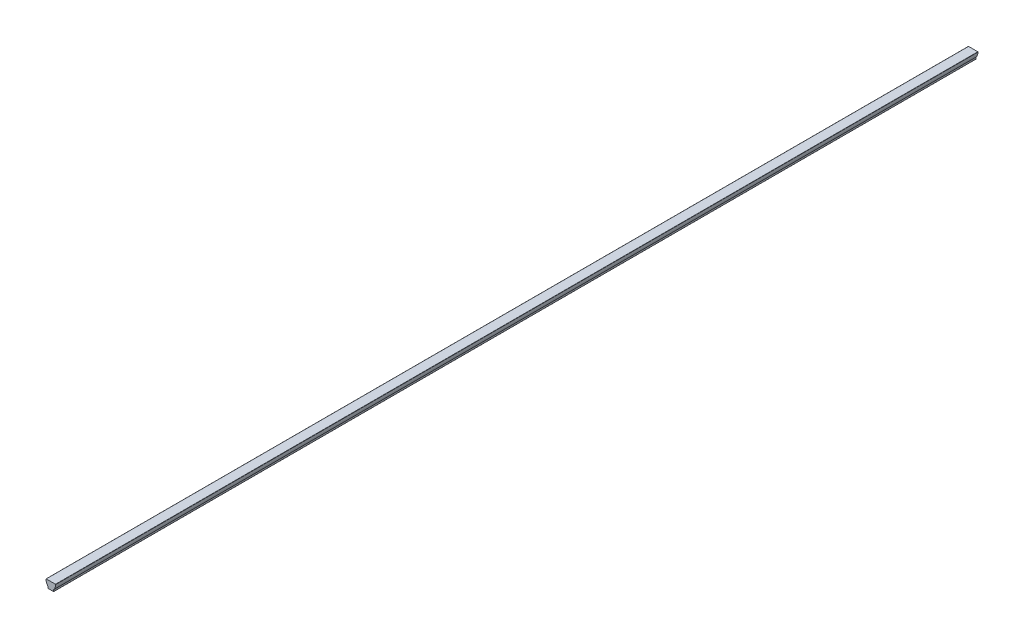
ISO-10303-21;
HEADER;
FILE_DESCRIPTION(('STEP AP214'),'2;1');
FILE_NAME('part.step','',(''),(''),'','','');
FILE_SCHEMA(('AUTOMOTIVE_DESIGN { 1 0 10303 214 1 1 1 1 }'));
ENDSEC;
DATA;
#1=APPLICATION_CONTEXT('core data for automotive mechanical design processes');
#2=APPLICATION_PROTOCOL_DEFINITION('international standard','automotive_design',2000,#1);
#3=PRODUCT_CONTEXT('',#1,'mechanical');
#4=PRODUCT('Part','Part','',(#3));
#5=PRODUCT_RELATED_PRODUCT_CATEGORY('part','',(#4));
#6=PRODUCT_DEFINITION_FORMATION('','',#4);
#7=PRODUCT_DEFINITION_CONTEXT('part definition',#1,'design');
#8=PRODUCT_DEFINITION('design','',#6,#7);
#9=PRODUCT_DEFINITION_SHAPE('','',#8);
#10=(LENGTH_UNIT() NAMED_UNIT(*) SI_UNIT(.MILLI.,.METRE.));
#11=(NAMED_UNIT(*) PLANE_ANGLE_UNIT() SI_UNIT($,.RADIAN.));
#12=(NAMED_UNIT(*) SI_UNIT($,.STERADIAN.) SOLID_ANGLE_UNIT());
#13=UNCERTAINTY_MEASURE_WITH_UNIT(LENGTH_MEASURE(1.E-05),#10,'distance_accuracy_value','');
#14=(GEOMETRIC_REPRESENTATION_CONTEXT(3) GLOBAL_UNCERTAINTY_ASSIGNED_CONTEXT((#13)) GLOBAL_UNIT_ASSIGNED_CONTEXT((#10,
#11,#12)) REPRESENTATION_CONTEXT('',''));
#15=CARTESIAN_POINT('',(0.,0.,0.));
#16=DIRECTION('',(0.,0.,1.));
#17=DIRECTION('',(1.,0.,0.));
#18=AXIS2_PLACEMENT_3D('',#15,#16,#17);
#19=CARTESIAN_POINT('',(-2.53828959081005,3.937,508.));
#20=DIRECTION('',(0.,0.,-1.));
#21=DIRECTION('',(-1.,0.,0.));
#22=AXIS2_PLACEMENT_3D('',#19,#20,#21);
#23=CYLINDRICAL_SURFACE('',#22,0.127);
#24=CARTESIAN_POINT('',(-2.53828959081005,3.937,0.));
#25=DIRECTION('',(0.,0.,1.));
#26=DIRECTION('',(-1.,0.,0.));
#27=AXIS2_PLACEMENT_3D('',#24,#25,#26);
#28=CIRCLE('',#27,0.127);
#29=CARTESIAN_POINT('',(-2.53828959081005,4.064,0.));
#30=VERTEX_POINT('',#29);
#31=CARTESIAN_POINT('',(-2.66524352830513,3.93357980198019,0.));
#32=VERTEX_POINT('',#31);
#33=EDGE_CURVE('E106',#30,#32,#28,.T.);
#34=ORIENTED_EDGE('',*,*,#33,.T.);
#35=DIRECTION('',(0.,0.,-1.));
#36=VECTOR('',#35,1.);
#37=CARTESIAN_POINT('',(-2.66524352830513,3.93357980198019,508.));
#38=LINE('',#37,#36);
#39=CARTESIAN_POINT('',(-2.66524352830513,3.93357980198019,508.));
#40=VERTEX_POINT('',#39);
#41=EDGE_CURVE('E9',#40,#32,#38,.T.);
#42=ORIENTED_EDGE('',*,*,#41,.F.);
#43=CARTESIAN_POINT('',(-2.53828959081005,3.937,508.));
#44=DIRECTION('',(0.,0.,1.));
#45=DIRECTION('',(-1.,0.,0.));
#46=AXIS2_PLACEMENT_3D('',#43,#44,#45);
#47=CIRCLE('',#46,0.127);
#48=CARTESIAN_POINT('',(-2.53828959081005,4.064,508.));
#49=VERTEX_POINT('',#48);
#50=EDGE_CURVE('E141',#49,#40,#47,.T.);
#51=ORIENTED_EDGE('',*,*,#50,.F.);
#52=DIRECTION('',(0.,0.,-1.));
#53=VECTOR('',#52,1.);
#54=CARTESIAN_POINT('',(-2.53828959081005,4.064,508.));
#55=LINE('',#54,#53);
#56=EDGE_CURVE('E119',#49,#30,#55,.T.);
#57=ORIENTED_EDGE('',*,*,#56,.T.);
#58=EDGE_LOOP('',(#34,#42,#51,#57));
#59=FACE_BOUND('',#58,.T.);
#60=ADVANCED_FACE('F14',(#59),#23,.T.);
#61=CARTESIAN_POINT('',(2.17580882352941,4.064,508.));
#62=DIRECTION('',(0.,0.,-1.));
#63=DIRECTION('',(-1.,0.,0.));
#64=AXIS2_PLACEMENT_3D('',#61,#62,#63);
#65=CYLINDRICAL_SURFACE('',#64,4.84280882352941);
#66=CARTESIAN_POINT('',(2.17580882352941,4.064,0.));
#67=DIRECTION('',(0.,0.,1.));
#68=DIRECTION('',(1.,0.,0.));
#69=AXIS2_PLACEMENT_3D('',#66,#67,#68);
#70=CIRCLE('',#69,4.84280882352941);
#71=CARTESIAN_POINT('',(-1.6150858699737,1.05037847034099,0.));
#72=VERTEX_POINT('',#71);
#73=EDGE_CURVE('E102',#32,#72,#70,.T.);
#74=ORIENTED_EDGE('',*,*,#73,.T.);
#75=DIRECTION('',(0.,0.,-1.));
#76=VECTOR('',#75,1.);
#77=CARTESIAN_POINT('',(-1.6150858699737,1.05037847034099,508.));
#78=LINE('',#77,#76);
#79=CARTESIAN_POINT('',(-1.6150858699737,1.05037847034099,508.));
#80=VERTEX_POINT('',#79);
#81=EDGE_CURVE('E21',#80,#72,#78,.T.);
#82=ORIENTED_EDGE('',*,*,#81,.F.);
#83=CARTESIAN_POINT('',(2.17580882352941,4.064,508.));
#84=DIRECTION('',(0.,0.,1.));
#85=DIRECTION('',(1.,0.,0.));
#86=AXIS2_PLACEMENT_3D('',#83,#84,#85);
#87=CIRCLE('',#86,4.84280882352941);
#88=EDGE_CURVE('E115',#40,#80,#87,.T.);
#89=ORIENTED_EDGE('',*,*,#88,.F.);
#90=ORIENTED_EDGE('',*,*,#41,.T.);
#91=EDGE_LOOP('',(#74,#82,#89,#90));
#92=FACE_BOUND('',#91,.T.);
#93=ADVANCED_FACE('F114',(#92),#65,.T.);
#94=CARTESIAN_POINT('',(-1.7145,0.971347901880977,508.));
#95=DIRECTION('',(0.,0.,-1.));
#96=DIRECTION('',(-1.,0.,0.));
#97=AXIS2_PLACEMENT_3D('',#94,#95,#96);
#98=CYLINDRICAL_SURFACE('',#97,0.127);
#99=CARTESIAN_POINT('',(-1.7145,0.971347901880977,0.));
#100=DIRECTION('',(0.,0.,-1.));
#101=DIRECTION('',(-1.,0.,0.));
#102=AXIS2_PLACEMENT_3D('',#99,#100,#101);
#103=CIRCLE('',#102,0.127);
#104=CARTESIAN_POINT('',(-1.5875,0.971347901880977,0.));
#105=VERTEX_POINT('',#104);
#106=EDGE_CURVE('E108',#72,#105,#103,.T.);
#107=ORIENTED_EDGE('',*,*,#106,.T.);
#108=DIRECTION('',(0.,0.,-1.));
#109=VECTOR('',#108,1.);
#110=CARTESIAN_POINT('',(-1.5875,0.971347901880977,508.));
#111=LINE('',#110,#109);
#112=CARTESIAN_POINT('',(-1.5875,0.971347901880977,508.));
#113=VERTEX_POINT('',#112);
#114=EDGE_CURVE('E187',#113,#105,#111,.T.);
#115=ORIENTED_EDGE('',*,*,#114,.F.);
#116=CARTESIAN_POINT('',(-1.7145,0.971347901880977,508.));
#117=DIRECTION('',(0.,0.,-1.));
#118=DIRECTION('',(-1.,0.,0.));
#119=AXIS2_PLACEMENT_3D('',#116,#117,#118);
#120=CIRCLE('',#119,0.127);
#121=EDGE_CURVE('E144',#80,#113,#120,.T.);
#122=ORIENTED_EDGE('',*,*,#121,.F.);
#123=ORIENTED_EDGE('',*,*,#81,.T.);
#124=EDGE_LOOP('',(#107,#115,#122,#123));
#125=FACE_BOUND('',#124,.T.);
#126=ADVANCED_FACE('F191',(#125),#98,.F.);
#127=CARTESIAN_POINT('',(-1.5875,0.127,508.));
#128=DIRECTION('',(1.,0.,0.));
#129=DIRECTION('',(0.,0.,-1.));
#130=AXIS2_PLACEMENT_3D('',#127,#128,#129);
#131=PLANE('',#130);
#132=DIRECTION('',(0.,-1.,0.));
#133=VECTOR('',#132,1.);
#134=CARTESIAN_POINT('',(-1.5875,0.127,0.));
#135=LINE('',#134,#133);
#136=CARTESIAN_POINT('',(-1.5875,0.127,0.));
#137=VERTEX_POINT('',#136);
#138=EDGE_CURVE('E123',#105,#137,#135,.T.);
#139=ORIENTED_EDGE('',*,*,#138,.T.);
#140=DIRECTION('',(0.,0.,-1.));
#141=VECTOR('',#140,1.);
#142=CARTESIAN_POINT('',(-1.5875,0.127,508.));
#143=LINE('',#142,#141);
#144=CARTESIAN_POINT('',(-1.5875,0.127,508.));
#145=VERTEX_POINT('',#144);
#146=EDGE_CURVE('E184',#145,#137,#143,.T.);
#147=ORIENTED_EDGE('',*,*,#146,.F.);
#148=DIRECTION('',(0.,-1.,0.));
#149=VECTOR('',#148,1.);
#150=CARTESIAN_POINT('',(-1.5875,0.127,508.));
#151=LINE('',#150,#149);
#152=EDGE_CURVE('E146',#113,#145,#151,.T.);
#153=ORIENTED_EDGE('',*,*,#152,.F.);
#154=ORIENTED_EDGE('',*,*,#114,.T.);
#155=EDGE_LOOP('',(#139,#147,#153,#154));
#156=FACE_BOUND('',#155,.T.);
#157=ADVANCED_FACE('F199',(#156),#131,.F.);
#158=CARTESIAN_POINT('',(-1.4605,0.127,508.));
#159=DIRECTION('',(0.,0.,-1.));
#160=DIRECTION('',(-1.,0.,0.));
#161=AXIS2_PLACEMENT_3D('',#158,#159,#160);
#162=CYLINDRICAL_SURFACE('',#161,0.127);
#163=CARTESIAN_POINT('',(-1.4605,0.127,0.));
#164=DIRECTION('',(0.,0.,1.));
#165=DIRECTION('',(1.,0.,0.));
#166=AXIS2_PLACEMENT_3D('',#163,#164,#165);
#167=CIRCLE('',#166,0.127);
#168=CARTESIAN_POINT('',(-1.4605,0.,0.));
#169=VERTEX_POINT('',#168);
#170=EDGE_CURVE('E125',#137,#169,#167,.T.);
#171=ORIENTED_EDGE('',*,*,#170,.T.);
#172=DIRECTION('',(0.,0.,-1.));
#173=VECTOR('',#172,1.);
#174=CARTESIAN_POINT('',(-1.4605,0.,508.));
#175=LINE('',#174,#173);
#176=CARTESIAN_POINT('',(-1.4605,0.,508.));
#177=VERTEX_POINT('',#176);
#178=EDGE_CURVE('E181',#177,#169,#175,.T.);
#179=ORIENTED_EDGE('',*,*,#178,.F.);
#180=CARTESIAN_POINT('',(-1.4605,0.127,508.));
#181=DIRECTION('',(0.,0.,1.));
#182=DIRECTION('',(1.,0.,0.));
#183=AXIS2_PLACEMENT_3D('',#180,#181,#182);
#184=CIRCLE('',#183,0.127);
#185=EDGE_CURVE('E148',#145,#177,#184,.T.);
#186=ORIENTED_EDGE('',*,*,#185,.F.);
#187=ORIENTED_EDGE('',*,*,#146,.T.);
#188=EDGE_LOOP('',(#171,#179,#186,#187));
#189=FACE_BOUND('',#188,.T.);
#190=ADVANCED_FACE('F202',(#189),#162,.T.);
#191=CARTESIAN_POINT('',(-1.4605,0.,508.));
#192=DIRECTION('',(0.,1.,0.));
#193=DIRECTION('',(0.,0.,1.));
#194=AXIS2_PLACEMENT_3D('',#191,#192,#193);
#195=PLANE('',#194);
#196=DIRECTION('',(1.,0.,0.));
#197=VECTOR('',#196,1.);
#198=CARTESIAN_POINT('',(-1.4605,0.,0.));
#199=LINE('',#198,#197);
#200=CARTESIAN_POINT('',(1.4605,0.,0.));
#201=VERTEX_POINT('',#200);
#202=EDGE_CURVE('E127',#169,#201,#199,.T.);
#203=ORIENTED_EDGE('',*,*,#202,.T.);
#204=DIRECTION('',(0.,0.,-1.));
#205=VECTOR('',#204,1.);
#206=CARTESIAN_POINT('',(1.4605,0.,508.));
#207=LINE('',#206,#205);
#208=CARTESIAN_POINT('',(1.4605,0.,508.));
#209=VERTEX_POINT('',#208);
#210=EDGE_CURVE('E178',#209,#201,#207,.T.);
#211=ORIENTED_EDGE('',*,*,#210,.F.);
#212=DIRECTION('',(1.,0.,0.));
#213=VECTOR('',#212,1.);
#214=CARTESIAN_POINT('',(-1.4605,0.,508.));
#215=LINE('',#214,#213);
#216=EDGE_CURVE('E150',#177,#209,#215,.T.);
#217=ORIENTED_EDGE('',*,*,#216,.F.);
#218=ORIENTED_EDGE('',*,*,#178,.T.);
#219=EDGE_LOOP('',(#203,#211,#217,#218));
#220=FACE_BOUND('',#219,.T.);
#221=ADVANCED_FACE('F207',(#220),#195,.F.);
#222=CARTESIAN_POINT('',(1.4605,0.127,508.));
#223=DIRECTION('',(0.,0.,-1.));
#224=DIRECTION('',(-1.,0.,0.));
#225=AXIS2_PLACEMENT_3D('',#222,#223,#224);
#226=CYLINDRICAL_SURFACE('',#225,0.127);
#227=CARTESIAN_POINT('',(1.4605,0.127,0.));
#228=DIRECTION('',(0.,0.,1.));
#229=DIRECTION('',(1.,0.,0.));
#230=AXIS2_PLACEMENT_3D('',#227,#228,#229);
#231=CIRCLE('',#230,0.127);
#232=CARTESIAN_POINT('',(1.5875,0.127,0.));
#233=VERTEX_POINT('',#232);
#234=EDGE_CURVE('E129',#201,#233,#231,.T.);
#235=ORIENTED_EDGE('',*,*,#234,.T.);
#236=DIRECTION('',(0.,0.,-1.));
#237=VECTOR('',#236,1.);
#238=CARTESIAN_POINT('',(1.5875,0.127,508.));
#239=LINE('',#238,#237);
#240=CARTESIAN_POINT('',(1.5875,0.127,508.));
#241=VERTEX_POINT('',#240);
#242=EDGE_CURVE('E175',#241,#233,#239,.T.);
#243=ORIENTED_EDGE('',*,*,#242,.F.);
#244=CARTESIAN_POINT('',(1.4605,0.127,508.));
#245=DIRECTION('',(0.,0.,1.));
#246=DIRECTION('',(1.,0.,0.));
#247=AXIS2_PLACEMENT_3D('',#244,#245,#246);
#248=CIRCLE('',#247,0.127);
#249=EDGE_CURVE('E152',#209,#241,#248,.T.);
#250=ORIENTED_EDGE('',*,*,#249,.F.);
#251=ORIENTED_EDGE('',*,*,#210,.T.);
#252=EDGE_LOOP('',(#235,#243,#250,#251));
#253=FACE_BOUND('',#252,.T.);
#254=ADVANCED_FACE('F213',(#253),#226,.T.);
#255=CARTESIAN_POINT('',(1.5875,0.127,508.));
#256=DIRECTION('',(-1.,0.,0.));
#257=DIRECTION('',(0.,0.,1.));
#258=AXIS2_PLACEMENT_3D('',#255,#256,#257);
#259=PLANE('',#258);
#260=DIRECTION('',(0.,1.,0.));
#261=VECTOR('',#260,1.);
#262=CARTESIAN_POINT('',(1.5875,0.127,0.));
#263=LINE('',#262,#261);
#264=CARTESIAN_POINT('',(1.5875,0.971347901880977,0.));
#265=VERTEX_POINT('',#264);
#266=EDGE_CURVE('E131',#233,#265,#263,.T.);
#267=ORIENTED_EDGE('',*,*,#266,.T.);
#268=DIRECTION('',(0.,0.,-1.));
#269=VECTOR('',#268,1.);
#270=CARTESIAN_POINT('',(1.5875,0.971347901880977,508.));
#271=LINE('',#270,#269);
#272=CARTESIAN_POINT('',(1.5875,0.971347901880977,508.));
#273=VERTEX_POINT('',#272);
#274=EDGE_CURVE('E172',#273,#265,#271,.T.);
#275=ORIENTED_EDGE('',*,*,#274,.F.);
#276=DIRECTION('',(0.,1.,0.));
#277=VECTOR('',#276,1.);
#278=CARTESIAN_POINT('',(1.5875,0.127,508.));
#279=LINE('',#278,#277);
#280=EDGE_CURVE('E154',#241,#273,#279,.T.);
#281=ORIENTED_EDGE('',*,*,#280,.F.);
#282=ORIENTED_EDGE('',*,*,#242,.T.);
#283=EDGE_LOOP('',(#267,#275,#281,#282));
#284=FACE_BOUND('',#283,.T.);
#285=ADVANCED_FACE('F217',(#284),#259,.F.);
#286=CARTESIAN_POINT('',(1.7145,0.971347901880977,508.));
#287=DIRECTION('',(0.,0.,-1.));
#288=DIRECTION('',(-1.,0.,0.));
#289=AXIS2_PLACEMENT_3D('',#286,#287,#288);
#290=CYLINDRICAL_SURFACE('',#289,0.127);
#291=CARTESIAN_POINT('',(1.7145,0.971347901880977,0.));
#292=DIRECTION('',(0.,0.,-1.));
#293=DIRECTION('',(-1.,0.,0.));
#294=AXIS2_PLACEMENT_3D('',#291,#292,#293);
#295=CIRCLE('',#294,0.127);
#296=CARTESIAN_POINT('',(1.6150858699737,1.05037847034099,0.));
#297=VERTEX_POINT('',#296);
#298=EDGE_CURVE('E133',#265,#297,#295,.T.);
#299=ORIENTED_EDGE('',*,*,#298,.T.);
#300=DIRECTION('',(0.,0.,-1.));
#301=VECTOR('',#300,1.);
#302=CARTESIAN_POINT('',(1.6150858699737,1.05037847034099,508.));
#303=LINE('',#302,#301);
#304=CARTESIAN_POINT('',(1.6150858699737,1.05037847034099,508.));
#305=VERTEX_POINT('',#304);
#306=EDGE_CURVE('E169',#305,#297,#303,.T.);
#307=ORIENTED_EDGE('',*,*,#306,.F.);
#308=CARTESIAN_POINT('',(1.7145,0.971347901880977,508.));
#309=DIRECTION('',(0.,0.,-1.));
#310=DIRECTION('',(-1.,0.,0.));
#311=AXIS2_PLACEMENT_3D('',#308,#309,#310);
#312=CIRCLE('',#311,0.127);
#313=EDGE_CURVE('E156',#273,#305,#312,.T.);
#314=ORIENTED_EDGE('',*,*,#313,.F.);
#315=ORIENTED_EDGE('',*,*,#274,.T.);
#316=EDGE_LOOP('',(#299,#307,#314,#315));
#317=FACE_BOUND('',#316,.T.);
#318=ADVANCED_FACE('F222',(#317),#290,.F.);
#319=CARTESIAN_POINT('',(-2.17580882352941,4.064,508.));
#320=DIRECTION('',(0.,0.,-1.));
#321=DIRECTION('',(-1.,0.,0.));
#322=AXIS2_PLACEMENT_3D('',#319,#320,#321);
#323=CYLINDRICAL_SURFACE('',#322,4.84280882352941);
#324=CARTESIAN_POINT('',(-2.17580882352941,4.064,0.));
#325=DIRECTION('',(0.,0.,1.));
#326=DIRECTION('',(-1.,0.,0.));
#327=AXIS2_PLACEMENT_3D('',#324,#325,#326);
#328=CIRCLE('',#327,4.84280882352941);
#329=CARTESIAN_POINT('',(2.66524352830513,3.93357980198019,0.));
#330=VERTEX_POINT('',#329);
#331=EDGE_CURVE('E135',#297,#330,#328,.T.);
#332=ORIENTED_EDGE('',*,*,#331,.T.);
#333=DIRECTION('',(0.,0.,-1.));
#334=VECTOR('',#333,1.);
#335=CARTESIAN_POINT('',(2.66524352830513,3.93357980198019,508.));
#336=LINE('',#335,#334);
#337=CARTESIAN_POINT('',(2.66524352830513,3.93357980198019,508.));
#338=VERTEX_POINT('',#337);
#339=EDGE_CURVE('E166',#338,#330,#336,.T.);
#340=ORIENTED_EDGE('',*,*,#339,.F.);
#341=CARTESIAN_POINT('',(-2.17580882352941,4.064,508.));
#342=DIRECTION('',(0.,0.,1.));
#343=DIRECTION('',(-1.,0.,0.));
#344=AXIS2_PLACEMENT_3D('',#341,#342,#343);
#345=CIRCLE('',#344,4.84280882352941);
#346=EDGE_CURVE('E158',#305,#338,#345,.T.);
#347=ORIENTED_EDGE('',*,*,#346,.F.);
#348=ORIENTED_EDGE('',*,*,#306,.T.);
#349=EDGE_LOOP('',(#332,#340,#347,#348));
#350=FACE_BOUND('',#349,.T.);
#351=ADVANCED_FACE('F226',(#350),#323,.T.);
#352=CARTESIAN_POINT('',(2.53828959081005,3.937,508.));
#353=DIRECTION('',(0.,0.,-1.));
#354=DIRECTION('',(-1.,0.,0.));
#355=AXIS2_PLACEMENT_3D('',#352,#353,#354);
#356=CYLINDRICAL_SURFACE('',#355,0.127);
#357=CARTESIAN_POINT('',(2.53828959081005,3.937,0.));
#358=DIRECTION('',(0.,0.,1.));
#359=DIRECTION('',(-1.,0.,0.));
#360=AXIS2_PLACEMENT_3D('',#357,#358,#359);
#361=CIRCLE('',#360,0.127);
#362=CARTESIAN_POINT('',(2.53828959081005,4.064,0.));
#363=VERTEX_POINT('',#362);
#364=EDGE_CURVE('E137',#330,#363,#361,.T.);
#365=ORIENTED_EDGE('',*,*,#364,.T.);
#366=DIRECTION('',(0.,0.,-1.));
#367=VECTOR('',#366,1.);
#368=CARTESIAN_POINT('',(2.53828959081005,4.064,508.));
#369=LINE('',#368,#367);
#370=CARTESIAN_POINT('',(2.53828959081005,4.064,508.));
#371=VERTEX_POINT('',#370);
#372=EDGE_CURVE('E163',#371,#363,#369,.T.);
#373=ORIENTED_EDGE('',*,*,#372,.F.);
#374=CARTESIAN_POINT('',(2.53828959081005,3.937,508.));
#375=DIRECTION('',(0.,0.,1.));
#376=DIRECTION('',(-1.,0.,0.));
#377=AXIS2_PLACEMENT_3D('',#374,#375,#376);
#378=CIRCLE('',#377,0.127);
#379=EDGE_CURVE('E33',#338,#371,#378,.T.);
#380=ORIENTED_EDGE('',*,*,#379,.F.);
#381=ORIENTED_EDGE('',*,*,#339,.T.);
#382=EDGE_LOOP('',(#365,#373,#380,#381));
#383=FACE_BOUND('',#382,.T.);
#384=ADVANCED_FACE('F230',(#383),#356,.T.);
#385=CARTESIAN_POINT('',(-2.53828959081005,4.064,508.));
#386=DIRECTION('',(0.,-1.,0.));
#387=DIRECTION('',(0.,0.,-1.));
#388=AXIS2_PLACEMENT_3D('',#385,#386,#387);
#389=PLANE('',#388);
#390=DIRECTION('',(-1.,0.,0.));
#391=VECTOR('',#390,1.);
#392=CARTESIAN_POINT('',(-2.53828959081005,4.064,0.));
#393=LINE('',#392,#391);
#394=EDGE_CURVE('E139',#363,#30,#393,.T.);
#395=ORIENTED_EDGE('',*,*,#394,.T.);
#396=ORIENTED_EDGE('',*,*,#56,.F.);
#397=DIRECTION('',(-1.,0.,0.));
#398=VECTOR('',#397,1.);
#399=CARTESIAN_POINT('',(-2.53828959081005,4.064,508.));
#400=LINE('',#399,#398);
#401=EDGE_CURVE('E28',#371,#49,#400,.T.);
#402=ORIENTED_EDGE('',*,*,#401,.F.);
#403=ORIENTED_EDGE('',*,*,#372,.T.);
#404=EDGE_LOOP('',(#395,#396,#402,#403));
#405=FACE_BOUND('',#404,.T.);
#406=ADVANCED_FACE('F232',(#405),#389,.F.);
#407=CARTESIAN_POINT('',(-2.53828959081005,3.937,508.));
#408=DIRECTION('',(0.,0.,-1.));
#409=DIRECTION('',(-1.,0.,0.));
#410=AXIS2_PLACEMENT_3D('',#407,#408,#409);
#411=PLANE('',#410);
#412=ORIENTED_EDGE('',*,*,#50,.T.);
#413=ORIENTED_EDGE('',*,*,#88,.T.);
#414=ORIENTED_EDGE('',*,*,#121,.T.);
#415=ORIENTED_EDGE('',*,*,#152,.T.);
#416=ORIENTED_EDGE('',*,*,#185,.T.);
#417=ORIENTED_EDGE('',*,*,#216,.T.);
#418=ORIENTED_EDGE('',*,*,#249,.T.);
#419=ORIENTED_EDGE('',*,*,#280,.T.);
#420=ORIENTED_EDGE('',*,*,#313,.T.);
#421=ORIENTED_EDGE('',*,*,#346,.T.);
#422=ORIENTED_EDGE('',*,*,#379,.T.);
#423=ORIENTED_EDGE('',*,*,#401,.T.);
#424=EDGE_LOOP('',(#412,#413,#414,#415,#416,#417,#418,#419,#420,#421,#422,#423));
#425=FACE_BOUND('',#424,.T.);
#426=ADVANCED_FACE('F194',(#425),#411,.F.);
#427=CARTESIAN_POINT('',(-2.53828959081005,3.937,0.));
#428=DIRECTION('',(0.,0.,-1.));
#429=DIRECTION('',(-1.,0.,0.));
#430=AXIS2_PLACEMENT_3D('',#427,#428,#429);
#431=PLANE('',#430);
#432=ORIENTED_EDGE('',*,*,#33,.F.);
#433=ORIENTED_EDGE('',*,*,#394,.F.);
#434=ORIENTED_EDGE('',*,*,#364,.F.);
#435=ORIENTED_EDGE('',*,*,#331,.F.);
#436=ORIENTED_EDGE('',*,*,#298,.F.);
#437=ORIENTED_EDGE('',*,*,#266,.F.);
#438=ORIENTED_EDGE('',*,*,#234,.F.);
#439=ORIENTED_EDGE('',*,*,#202,.F.);
#440=ORIENTED_EDGE('',*,*,#170,.F.);
#441=ORIENTED_EDGE('',*,*,#138,.F.);
#442=ORIENTED_EDGE('',*,*,#106,.F.);
#443=ORIENTED_EDGE('',*,*,#73,.F.);
#444=EDGE_LOOP('',(#432,#433,#434,#435,#436,#437,#438,#439,#440,#441,#442,#443));
#445=FACE_BOUND('',#444,.T.);
#446=ADVANCED_FACE('F103',(#445),#431,.T.);
#447=CLOSED_SHELL('',(#60,#93,#126,#157,#190,#221,#254,#285,#318,#351,#384,#406,#426,#446));
#448=MANIFOLD_SOLID_BREP('B1',#447);
#449=ADVANCED_BREP_SHAPE_REPRESENTATION('',(#18,#448),#14);
#450=SHAPE_DEFINITION_REPRESENTATION(#9,#449);
ENDSEC;
END-ISO-10303-21;
